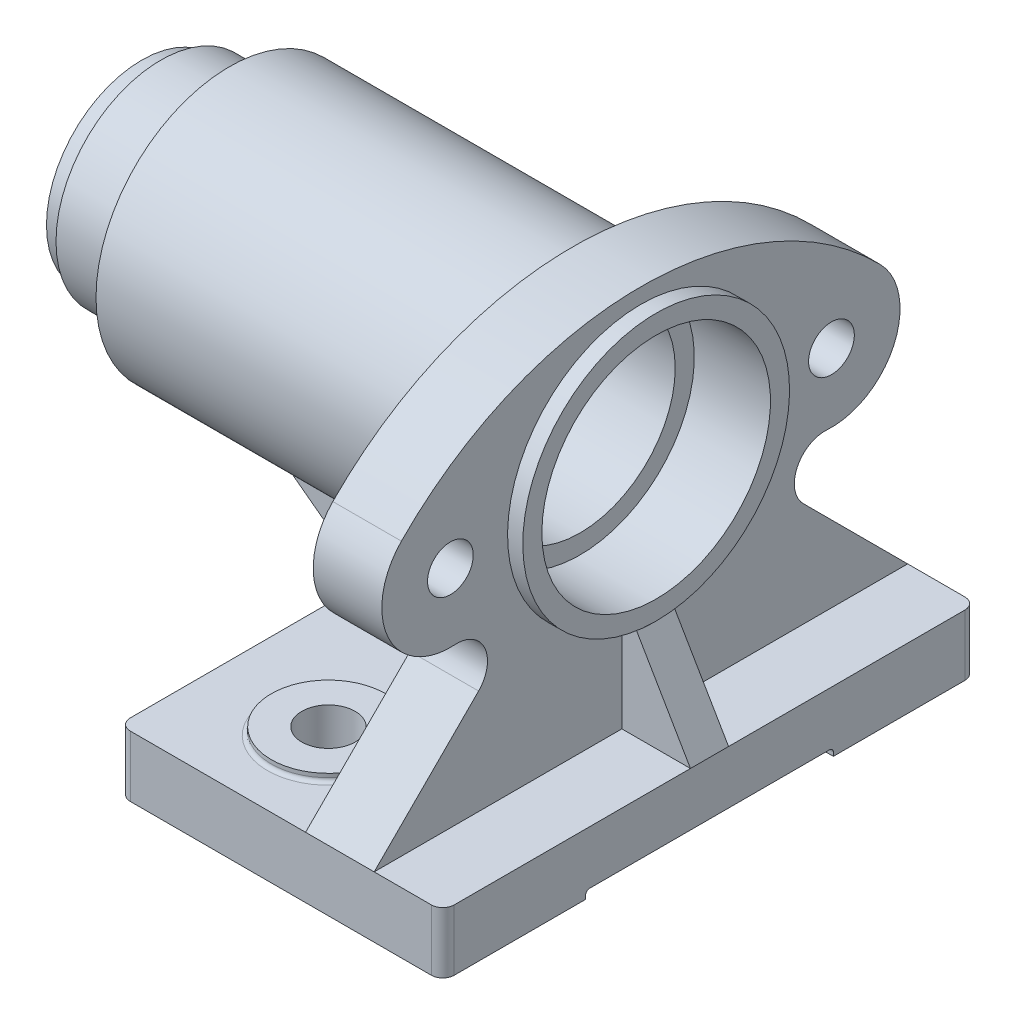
ISO-10303-21;
HEADER;
FILE_DESCRIPTION(('STEP AP214'),'2;1');
FILE_NAME('part.step','',(''),(''),'','','');
FILE_SCHEMA(('AUTOMOTIVE_DESIGN { 1 0 10303 214 1 1 1 1 }'));
ENDSEC;
DATA;
#1=APPLICATION_CONTEXT('core data for automotive mechanical design processes');
#2=APPLICATION_PROTOCOL_DEFINITION('international standard','automotive_design',2000,#1);
#3=PRODUCT_CONTEXT('',#1,'mechanical');
#4=PRODUCT('Part','Part','',(#3));
#5=PRODUCT_RELATED_PRODUCT_CATEGORY('part','',(#4));
#6=PRODUCT_DEFINITION_FORMATION('','',#4);
#7=PRODUCT_DEFINITION_CONTEXT('part definition',#1,'design');
#8=PRODUCT_DEFINITION('design','',#6,#7);
#9=PRODUCT_DEFINITION_SHAPE('','',#8);
#10=(LENGTH_UNIT() NAMED_UNIT(*) SI_UNIT(.MILLI.,.METRE.));
#11=(NAMED_UNIT(*) PLANE_ANGLE_UNIT() SI_UNIT($,.RADIAN.));
#12=(NAMED_UNIT(*) SI_UNIT($,.STERADIAN.) SOLID_ANGLE_UNIT());
#13=UNCERTAINTY_MEASURE_WITH_UNIT(LENGTH_MEASURE(1.E-05),#10,'distance_accuracy_value','');
#14=(GEOMETRIC_REPRESENTATION_CONTEXT(3) GLOBAL_UNCERTAINTY_ASSIGNED_CONTEXT((#13)) GLOBAL_UNIT_ASSIGNED_CONTEXT((#10,
#11,#12)) REPRESENTATION_CONTEXT('',''));
#15=CARTESIAN_POINT('',(0.,0.,0.));
#16=DIRECTION('',(0.,0.,1.));
#17=DIRECTION('',(1.,0.,0.));
#18=AXIS2_PLACEMENT_3D('',#15,#16,#17);
#19=CARTESIAN_POINT('',(-85.,0.,70.));
#20=DIRECTION('',(0.,1.,0.));
#21=DIRECTION('',(-1.,0.,0.));
#22=AXIS2_PLACEMENT_3D('',#19,#20,#21);
#23=PLANE('',#22);
#24=CARTESIAN_POINT('',(-55.,0.,45.));
#25=DIRECTION('',(0.,1.,0.));
#26=DIRECTION('',(-1.,0.,0.));
#27=AXIS2_PLACEMENT_3D('',#24,#25,#26);
#28=CIRCLE('',#27,7.);
#29=CARTESIAN_POINT('',(-62.,0.,45.));
#30=VERTEX_POINT('',#29);
#31=EDGE_CURVE('E662',#30,#30,#28,.T.);
#32=ORIENTED_EDGE('',*,*,#31,.T.);
#33=EDGE_LOOP('',(#32));
#34=FACE_BOUND('',#33,.T.);
#35=DIRECTION('',(1.,0.,0.));
#36=VECTOR('',#35,1.);
#37=CARTESIAN_POINT('',(-85.,0.,70.));
#38=LINE('',#37,#36);
#39=CARTESIAN_POINT('',(-82.,0.,70.));
#40=VERTEX_POINT('',#39);
#41=CARTESIAN_POINT('',(-3.,0.,70.));
#42=VERTEX_POINT('',#41);
#43=EDGE_CURVE('E286',#40,#42,#38,.T.);
#44=ORIENTED_EDGE('',*,*,#43,.F.);
#45=CARTESIAN_POINT('',(-82.,0.,67.));
#46=DIRECTION('',(0.,1.,0.));
#47=DIRECTION('',(-1.,0.,0.));
#48=AXIS2_PLACEMENT_3D('',#45,#46,#47);
#49=CIRCLE('',#48,3.);
#50=CARTESIAN_POINT('',(-85.,0.,67.));
#51=VERTEX_POINT('',#50);
#52=EDGE_CURVE('E485',#40,#51,#49,.F.);
#53=ORIENTED_EDGE('',*,*,#52,.T.);
#54=DIRECTION('',(0.,0.,-1.));
#55=VECTOR('',#54,1.);
#56=CARTESIAN_POINT('',(-85.,0.,70.));
#57=LINE('',#56,#55);
#58=CARTESIAN_POINT('',(-85.,0.,32.5));
#59=VERTEX_POINT('',#58);
#60=EDGE_CURVE('E281',#51,#59,#57,.T.);
#61=ORIENTED_EDGE('',*,*,#60,.T.);
#62=DIRECTION('',(1.,0.,0.));
#63=VECTOR('',#62,1.);
#64=CARTESIAN_POINT('',(-92.,0.,32.5));
#65=LINE('',#64,#63);
#66=CARTESIAN_POINT('',(0.,0.,32.5));
#67=VERTEX_POINT('',#66);
#68=EDGE_CURVE('E243',#59,#67,#65,.T.);
#69=ORIENTED_EDGE('',*,*,#68,.T.);
#70=DIRECTION('',(0.,0.,-1.));
#71=VECTOR('',#70,1.);
#72=CARTESIAN_POINT('',(0.,0.,70.));
#73=LINE('',#72,#71);
#74=CARTESIAN_POINT('',(0.,0.,67.));
#75=VERTEX_POINT('',#74);
#76=EDGE_CURVE('E260',#75,#67,#73,.T.);
#77=ORIENTED_EDGE('',*,*,#76,.F.);
#78=CARTESIAN_POINT('',(-3.,0.,67.));
#79=DIRECTION('',(0.,1.,0.));
#80=DIRECTION('',(-1.,0.,0.));
#81=AXIS2_PLACEMENT_3D('',#78,#79,#80);
#82=CIRCLE('',#81,3.);
#83=EDGE_CURVE('E489',#75,#42,#82,.F.);
#84=ORIENTED_EDGE('',*,*,#83,.T.);
#85=EDGE_LOOP('',(#44,#53,#61,#69,#77,#84));
#86=FACE_BOUND('',#85,.T.);
#87=ADVANCED_FACE('F33',(#34,#86),#23,.F.);
#88=CARTESIAN_POINT('',(0.,16.,70.));
#89=DIRECTION('',(0.,-1.,0.));
#90=DIRECTION('',(1.,0.,0.));
#91=AXIS2_PLACEMENT_3D('',#88,#89,#90);
#92=PLANE('',#91);
#93=CARTESIAN_POINT('',(-55.,16.,45.));
#94=DIRECTION('',(0.,-1.,0.));
#95=DIRECTION('',(1.,0.,0.));
#96=AXIS2_PLACEMENT_3D('',#93,#94,#95);
#97=CIRCLE('',#96,16.);
#98=CARTESIAN_POINT('',(-39.,16.,45.));
#99=VERTEX_POINT('',#98);
#100=EDGE_CURVE('E306',#99,#99,#97,.T.);
#101=ORIENTED_EDGE('',*,*,#100,.T.);
#102=EDGE_LOOP('',(#101));
#103=FACE_BOUND('',#102,.T.);
#104=DIRECTION('',(0.,0.,-1.));
#105=VECTOR('',#104,1.);
#106=CARTESIAN_POINT('',(-85.,16.,70.));
#107=LINE('',#106,#105);
#108=CARTESIAN_POINT('',(-85.,16.,67.));
#109=VERTEX_POINT('',#108);
#110=CARTESIAN_POINT('',(-85.,16.,5.));
#111=VERTEX_POINT('',#110);
#112=EDGE_CURVE('E505',#109,#111,#107,.T.);
#113=ORIENTED_EDGE('',*,*,#112,.F.);
#114=CARTESIAN_POINT('',(-82.,16.,67.));
#115=DIRECTION('',(0.,-1.,0.));
#116=DIRECTION('',(1.,0.,0.));
#117=AXIS2_PLACEMENT_3D('',#114,#115,#116);
#118=CIRCLE('',#117,3.);
#119=CARTESIAN_POINT('',(-82.,16.,70.));
#120=VERTEX_POINT('',#119);
#121=EDGE_CURVE('E487',#109,#120,#118,.F.);
#122=ORIENTED_EDGE('',*,*,#121,.T.);
#123=DIRECTION('',(-1.,0.,0.));
#124=VECTOR('',#123,1.);
#125=CARTESIAN_POINT('',(0.,16.,70.));
#126=LINE('',#125,#124);
#127=CARTESIAN_POINT('',(-36.,16.,70.));
#128=VERTEX_POINT('',#127);
#129=EDGE_CURVE('E275',#128,#120,#126,.T.);
#130=ORIENTED_EDGE('',*,*,#129,.F.);
#131=DIRECTION('',(0.,0.,-1.));
#132=VECTOR('',#131,1.);
#133=CARTESIAN_POINT('',(-36.,16.,70.));
#134=LINE('',#133,#132);
#135=CARTESIAN_POINT('',(-36.,16.,5.));
#136=VERTEX_POINT('',#135);
#137=EDGE_CURVE('E408',#128,#136,#134,.T.);
#138=ORIENTED_EDGE('',*,*,#137,.T.);
#139=DIRECTION('',(-1.,0.,0.));
#140=VECTOR('',#139,1.);
#141=CARTESIAN_POINT('',(0.,16.,5.));
#142=LINE('',#141,#140);
#143=EDGE_CURVE('E687',#136,#111,#142,.T.);
#144=ORIENTED_EDGE('',*,*,#143,.T.);
#145=EDGE_LOOP('',(#113,#122,#130,#138,#144));
#146=FACE_BOUND('',#145,.T.);
#147=ADVANCED_FACE('F522',(#103,#146),#92,.F.);
#148=CARTESIAN_POINT('',(-55.,16.,-45.));
#149=DIRECTION('',(0.,-1.,0.));
#150=DIRECTION('',(1.,0.,0.));
#151=AXIS2_PLACEMENT_3D('',#148,#149,#150);
#152=CIRCLE('',#151,16.);
#153=CARTESIAN_POINT('',(-39.,16.,-45.));
#154=VERTEX_POINT('',#153);
#155=EDGE_CURVE('E312',#154,#154,#152,.T.);
#156=ORIENTED_EDGE('',*,*,#155,.T.);
#157=EDGE_LOOP('',(#156));
#158=FACE_BOUND('',#157,.T.);
#159=DIRECTION('',(-1.,0.,0.));
#160=VECTOR('',#159,1.);
#161=CARTESIAN_POINT('',(0.,16.,-70.));
#162=LINE('',#161,#160);
#163=CARTESIAN_POINT('',(-36.,16.,-70.));
#164=VERTEX_POINT('',#163);
#165=CARTESIAN_POINT('',(-82.,16.,-70.));
#166=VERTEX_POINT('',#165);
#167=EDGE_CURVE('E269',#164,#166,#162,.T.);
#168=ORIENTED_EDGE('',*,*,#167,.T.);
#169=CARTESIAN_POINT('',(-82.,16.,-67.));
#170=DIRECTION('',(0.,-1.,0.));
#171=DIRECTION('',(1.,0.,0.));
#172=AXIS2_PLACEMENT_3D('',#169,#170,#171);
#173=CIRCLE('',#172,3.);
#174=CARTESIAN_POINT('',(-85.,16.,-67.));
#175=VERTEX_POINT('',#174);
#176=EDGE_CURVE('E293',#166,#175,#173,.F.);
#177=ORIENTED_EDGE('',*,*,#176,.T.);
#178=CARTESIAN_POINT('',(-85.,16.,-5.));
#179=VERTEX_POINT('',#178);
#180=EDGE_CURVE('E506',#179,#175,#107,.T.);
#181=ORIENTED_EDGE('',*,*,#180,.F.);
#182=DIRECTION('',(-1.,0.,0.));
#183=VECTOR('',#182,1.);
#184=CARTESIAN_POINT('',(0.,16.,-5.));
#185=LINE('',#184,#183);
#186=CARTESIAN_POINT('',(-36.,16.,-5.));
#187=VERTEX_POINT('',#186);
#188=EDGE_CURVE('E678',#187,#179,#185,.T.);
#189=ORIENTED_EDGE('',*,*,#188,.F.);
#190=EDGE_CURVE('E406',#187,#164,#134,.T.);
#191=ORIENTED_EDGE('',*,*,#190,.T.);
#192=EDGE_LOOP('',(#168,#177,#181,#189,#191));
#193=FACE_BOUND('',#192,.T.);
#194=ADVANCED_FACE('F477',(#158,#193),#92,.F.);
#195=DIRECTION('',(0.,0.,-1.));
#196=VECTOR('',#195,1.);
#197=CARTESIAN_POINT('',(0.,16.,70.));
#198=LINE('',#197,#196);
#199=CARTESIAN_POINT('',(0.,16.,-5.));
#200=VERTEX_POINT('',#199);
#201=CARTESIAN_POINT('',(0.,16.,-67.));
#202=VERTEX_POINT('',#201);
#203=EDGE_CURVE('E265',#200,#202,#198,.T.);
#204=ORIENTED_EDGE('',*,*,#203,.T.);
#205=CARTESIAN_POINT('',(-3.,16.,-67.));
#206=DIRECTION('',(0.,-1.,0.));
#207=DIRECTION('',(1.,0.,0.));
#208=AXIS2_PLACEMENT_3D('',#205,#206,#207);
#209=CIRCLE('',#208,3.);
#210=CARTESIAN_POINT('',(-3.,16.,-70.));
#211=VERTEX_POINT('',#210);
#212=EDGE_CURVE('E299',#202,#211,#209,.F.);
#213=ORIENTED_EDGE('',*,*,#212,.T.);
#214=CARTESIAN_POINT('',(-18.,16.,-70.));
#215=VERTEX_POINT('',#214);
#216=EDGE_CURVE('E273',#211,#215,#162,.T.);
#217=ORIENTED_EDGE('',*,*,#216,.T.);
#218=DIRECTION('',(0.,0.,-1.));
#219=VECTOR('',#218,1.);
#220=CARTESIAN_POINT('',(-18.,16.,70.));
#221=LINE('',#220,#219);
#222=CARTESIAN_POINT('',(-18.,16.,-5.));
#223=VERTEX_POINT('',#222);
#224=EDGE_CURVE('E398',#223,#215,#221,.T.);
#225=ORIENTED_EDGE('',*,*,#224,.F.);
#226=DIRECTION('',(-1.,0.,0.));
#227=VECTOR('',#226,1.);
#228=CARTESIAN_POINT('',(0.,16.,-5.));
#229=LINE('',#228,#227);
#230=EDGE_CURVE('E504',#200,#223,#229,.T.);
#231=ORIENTED_EDGE('',*,*,#230,.F.);
#232=EDGE_LOOP('',(#204,#213,#217,#225,#231));
#233=FACE_BOUND('',#232,.T.);
#234=ADVANCED_FACE('F501',(#233),#92,.F.);
#235=CARTESIAN_POINT('',(-3.,16.,70.));
#236=VERTEX_POINT('',#235);
#237=CARTESIAN_POINT('',(-18.,16.,70.));
#238=VERTEX_POINT('',#237);
#239=EDGE_CURVE('E349',#236,#238,#126,.T.);
#240=ORIENTED_EDGE('',*,*,#239,.F.);
#241=CARTESIAN_POINT('',(-3.,16.,67.));
#242=DIRECTION('',(0.,-1.,0.));
#243=DIRECTION('',(1.,0.,0.));
#244=AXIS2_PLACEMENT_3D('',#241,#242,#243);
#245=CIRCLE('',#244,3.);
#246=CARTESIAN_POINT('',(0.,16.,67.));
#247=VERTEX_POINT('',#246);
#248=EDGE_CURVE('E301',#236,#247,#245,.F.);
#249=ORIENTED_EDGE('',*,*,#248,.T.);
#250=CARTESIAN_POINT('',(0.,16.,5.));
#251=VERTEX_POINT('',#250);
#252=EDGE_CURVE('E261',#247,#251,#198,.T.);
#253=ORIENTED_EDGE('',*,*,#252,.T.);
#254=DIRECTION('',(-1.,0.,0.));
#255=VECTOR('',#254,1.);
#256=CARTESIAN_POINT('',(0.,16.,5.));
#257=LINE('',#256,#255);
#258=CARTESIAN_POINT('',(-18.,16.,5.));
#259=VERTEX_POINT('',#258);
#260=EDGE_CURVE('E541',#251,#259,#257,.T.);
#261=ORIENTED_EDGE('',*,*,#260,.T.);
#262=EDGE_CURVE('E394',#238,#259,#221,.T.);
#263=ORIENTED_EDGE('',*,*,#262,.F.);
#264=EDGE_LOOP('',(#240,#249,#253,#261,#263));
#265=FACE_BOUND('',#264,.T.);
#266=ADVANCED_FACE('F539',(#265),#92,.F.);
#267=CARTESIAN_POINT('',(-55.,0.,-45.));
#268=DIRECTION('',(0.,1.,0.));
#269=DIRECTION('',(-1.,0.,0.));
#270=AXIS2_PLACEMENT_3D('',#267,#268,#269);
#271=CIRCLE('',#270,7.);
#272=CARTESIAN_POINT('',(-62.,0.,-45.));
#273=VERTEX_POINT('',#272);
#274=EDGE_CURVE('E653',#273,#273,#271,.T.);
#275=ORIENTED_EDGE('',*,*,#274,.T.);
#276=EDGE_LOOP('',(#275));
#277=FACE_BOUND('',#276,.T.);
#278=CARTESIAN_POINT('',(-85.,0.,-32.5));
#279=VERTEX_POINT('',#278);
#280=CARTESIAN_POINT('',(-85.,0.,-67.));
#281=VERTEX_POINT('',#280);
#282=EDGE_CURVE('E350',#279,#281,#57,.T.);
#283=ORIENTED_EDGE('',*,*,#282,.T.);
#284=CARTESIAN_POINT('',(-82.,0.,-67.));
#285=DIRECTION('',(0.,1.,0.));
#286=DIRECTION('',(-1.,0.,0.));
#287=AXIS2_PLACEMENT_3D('',#284,#285,#286);
#288=CIRCLE('',#287,3.);
#289=CARTESIAN_POINT('',(-82.,0.,-70.));
#290=VERTEX_POINT('',#289);
#291=EDGE_CURVE('E287',#281,#290,#288,.F.);
#292=ORIENTED_EDGE('',*,*,#291,.T.);
#293=DIRECTION('',(1.,0.,0.));
#294=VECTOR('',#293,1.);
#295=CARTESIAN_POINT('',(-85.,0.,-70.));
#296=LINE('',#295,#294);
#297=CARTESIAN_POINT('',(-3.,0.,-70.));
#298=VERTEX_POINT('',#297);
#299=EDGE_CURVE('E274',#290,#298,#296,.T.);
#300=ORIENTED_EDGE('',*,*,#299,.T.);
#301=CARTESIAN_POINT('',(-3.,0.,-67.));
#302=DIRECTION('',(0.,1.,0.));
#303=DIRECTION('',(-1.,0.,0.));
#304=AXIS2_PLACEMENT_3D('',#301,#302,#303);
#305=CIRCLE('',#304,3.);
#306=CARTESIAN_POINT('',(0.,0.,-67.));
#307=VERTEX_POINT('',#306);
#308=EDGE_CURVE('E259',#298,#307,#305,.F.);
#309=ORIENTED_EDGE('',*,*,#308,.T.);
#310=CARTESIAN_POINT('',(0.,0.,-32.5));
#311=VERTEX_POINT('',#310);
#312=EDGE_CURVE('E250',#311,#307,#73,.T.);
#313=ORIENTED_EDGE('',*,*,#312,.F.);
#314=DIRECTION('',(1.,0.,0.));
#315=VECTOR('',#314,1.);
#316=CARTESIAN_POINT('',(-92.,0.,-32.5));
#317=LINE('',#316,#315);
#318=EDGE_CURVE('E232',#279,#311,#317,.T.);
#319=ORIENTED_EDGE('',*,*,#318,.F.);
#320=EDGE_LOOP('',(#283,#292,#300,#309,#313,#319));
#321=FACE_BOUND('',#320,.T.);
#322=ADVANCED_FACE('F256',(#277,#321),#23,.F.);
#323=CARTESIAN_POINT('',(0.,0.,70.));
#324=DIRECTION('',(-1.,0.,0.));
#325=DIRECTION('',(0.,-1.,0.));
#326=AXIS2_PLACEMENT_3D('',#323,#324,#325);
#327=PLANE('',#326);
#328=ORIENTED_EDGE('',*,*,#312,.T.);
#329=DIRECTION('',(0.,1.,0.));
#330=VECTOR('',#329,1.);
#331=CARTESIAN_POINT('',(0.,0.,-67.));
#332=LINE('',#331,#330);
#333=EDGE_CURVE('E297',#307,#202,#332,.T.);
#334=ORIENTED_EDGE('',*,*,#333,.T.);
#335=ORIENTED_EDGE('',*,*,#203,.F.);
#336=DIRECTION('',(0.,0.,-1.));
#337=VECTOR('',#336,1.);
#338=CARTESIAN_POINT('',(0.,16.,70.));
#339=LINE('',#338,#337);
#340=EDGE_CURVE('E570',#251,#200,#339,.T.);
#341=ORIENTED_EDGE('',*,*,#340,.F.);
#342=ORIENTED_EDGE('',*,*,#252,.F.);
#343=DIRECTION('',(0.,1.,0.));
#344=VECTOR('',#343,1.);
#345=CARTESIAN_POINT('',(0.,0.,67.));
#346=LINE('',#345,#344);
#347=EDGE_CURVE('E295',#247,#75,#346,.F.);
#348=ORIENTED_EDGE('',*,*,#347,.T.);
#349=ORIENTED_EDGE('',*,*,#76,.T.);
#350=DIRECTION('',(0.,-1.,0.));
#351=VECTOR('',#350,1.);
#352=CARTESIAN_POINT('',(0.,0.,32.5));
#353=LINE('',#352,#351);
#354=CARTESIAN_POINT('',(0.,1.,32.5));
#355=VERTEX_POINT('',#354);
#356=EDGE_CURVE('E244',#355,#67,#353,.T.);
#357=ORIENTED_EDGE('',*,*,#356,.F.);
#358=CARTESIAN_POINT('',(0.,1.,31.5));
#359=DIRECTION('',(-1.,0.,0.));
#360=DIRECTION('',(0.,-1.,0.));
#361=AXIS2_PLACEMENT_3D('',#358,#359,#360);
#362=CIRCLE('',#361,1.);
#363=CARTESIAN_POINT('',(0.,2.,31.5));
#364=VERTEX_POINT('',#363);
#365=EDGE_CURVE('E41',#355,#364,#362,.T.);
#366=ORIENTED_EDGE('',*,*,#365,.T.);
#367=DIRECTION('',(0.,0.,1.));
#368=VECTOR('',#367,1.);
#369=CARTESIAN_POINT('',(0.,2.,32.5));
#370=LINE('',#369,#368);
#371=CARTESIAN_POINT('',(0.,2.,-31.5));
#372=VERTEX_POINT('',#371);
#373=EDGE_CURVE('E254',#372,#364,#370,.T.);
#374=ORIENTED_EDGE('',*,*,#373,.F.);
#375=CARTESIAN_POINT('',(0.,1.,-31.5));
#376=DIRECTION('',(-1.,0.,0.));
#377=DIRECTION('',(0.,-1.,0.));
#378=AXIS2_PLACEMENT_3D('',#375,#376,#377);
#379=CIRCLE('',#378,1.);
#380=CARTESIAN_POINT('',(0.,1.,-32.5));
#381=VERTEX_POINT('',#380);
#382=EDGE_CURVE('E253',#372,#381,#379,.T.);
#383=ORIENTED_EDGE('',*,*,#382,.T.);
#384=DIRECTION('',(0.,1.,0.));
#385=VECTOR('',#384,1.);
#386=CARTESIAN_POINT('',(0.,2.,-32.5));
#387=LINE('',#386,#385);
#388=EDGE_CURVE('E235',#311,#381,#387,.T.);
#389=ORIENTED_EDGE('',*,*,#388,.F.);
#390=EDGE_LOOP('',(#328,#334,#335,#341,#342,#348,#349,#357,#366,#374,#383,#389));
#391=FACE_BOUND('',#390,.T.);
#392=ADVANCED_FACE('F248',(#391),#327,.F.);
#393=CARTESIAN_POINT('',(-85.,16.,70.));
#394=DIRECTION('',(1.,0.,0.));
#395=DIRECTION('',(0.,0.,-1.));
#396=AXIS2_PLACEMENT_3D('',#393,#394,#395);
#397=PLANE('',#396);
#398=ORIENTED_EDGE('',*,*,#60,.F.);
#399=DIRECTION('',(0.,-1.,0.));
#400=VECTOR('',#399,1.);
#401=CARTESIAN_POINT('',(-85.,16.,67.));
#402=LINE('',#401,#400);
#403=EDGE_CURVE('E484',#51,#109,#402,.F.);
#404=ORIENTED_EDGE('',*,*,#403,.T.);
#405=ORIENTED_EDGE('',*,*,#112,.T.);
#406=DIRECTION('',(0.,0.,1.));
#407=VECTOR('',#406,1.);
#408=CARTESIAN_POINT('',(-85.,16.,70.));
#409=LINE('',#408,#407);
#410=EDGE_CURVE('E691',#111,#179,#409,.F.);
#411=ORIENTED_EDGE('',*,*,#410,.T.);
#412=ORIENTED_EDGE('',*,*,#180,.T.);
#413=DIRECTION('',(0.,-1.,0.));
#414=VECTOR('',#413,1.);
#415=CARTESIAN_POINT('',(-85.,16.,-67.));
#416=LINE('',#415,#414);
#417=EDGE_CURVE('E483',#175,#281,#416,.T.);
#418=ORIENTED_EDGE('',*,*,#417,.T.);
#419=ORIENTED_EDGE('',*,*,#282,.F.);
#420=DIRECTION('',(0.,1.,0.));
#421=VECTOR('',#420,1.);
#422=CARTESIAN_POINT('',(-85.,16.,-32.5));
#423=LINE('',#422,#421);
#424=CARTESIAN_POINT('',(-85.,1.,-32.5));
#425=VERTEX_POINT('',#424);
#426=EDGE_CURVE('E238',#279,#425,#423,.T.);
#427=ORIENTED_EDGE('',*,*,#426,.T.);
#428=CARTESIAN_POINT('',(-85.,1.,-31.5));
#429=DIRECTION('',(1.,0.,0.));
#430=DIRECTION('',(0.,0.,-1.));
#431=AXIS2_PLACEMENT_3D('',#428,#429,#430);
#432=CIRCLE('',#431,1.);
#433=CARTESIAN_POINT('',(-85.,2.,-31.5));
#434=VERTEX_POINT('',#433);
#435=EDGE_CURVE('E325',#425,#434,#432,.T.);
#436=ORIENTED_EDGE('',*,*,#435,.T.);
#437=DIRECTION('',(0.,0.,1.));
#438=VECTOR('',#437,1.);
#439=CARTESIAN_POINT('',(-85.,2.,70.));
#440=LINE('',#439,#438);
#441=CARTESIAN_POINT('',(-85.,2.,31.5));
#442=VERTEX_POINT('',#441);
#443=EDGE_CURVE('E341',#434,#442,#440,.T.);
#444=ORIENTED_EDGE('',*,*,#443,.T.);
#445=CARTESIAN_POINT('',(-85.,1.,31.5));
#446=DIRECTION('',(1.,0.,0.));
#447=DIRECTION('',(0.,0.,-1.));
#448=AXIS2_PLACEMENT_3D('',#445,#446,#447);
#449=CIRCLE('',#448,1.);
#450=CARTESIAN_POINT('',(-85.,1.,32.5));
#451=VERTEX_POINT('',#450);
#452=EDGE_CURVE('E11',#442,#451,#449,.T.);
#453=ORIENTED_EDGE('',*,*,#452,.T.);
#454=DIRECTION('',(0.,-1.,0.));
#455=VECTOR('',#454,1.);
#456=CARTESIAN_POINT('',(-85.,16.,32.5));
#457=LINE('',#456,#455);
#458=EDGE_CURVE('E336',#451,#59,#457,.T.);
#459=ORIENTED_EDGE('',*,*,#458,.T.);
#460=EDGE_LOOP('',(#398,#404,#405,#411,#412,#418,#419,#427,#436,#444,#453,#459));
#461=FACE_BOUND('',#460,.T.);
#462=ADVANCED_FACE('F514',(#461),#397,.F.);
#463=CARTESIAN_POINT('',(0.,0.,70.));
#464=DIRECTION('',(0.,0.,1.));
#465=DIRECTION('',(1.,0.,0.));
#466=AXIS2_PLACEMENT_3D('',#463,#464,#465);
#467=PLANE('',#466);
#468=ORIENTED_EDGE('',*,*,#129,.T.);
#469=DIRECTION('',(0.,-1.,0.));
#470=VECTOR('',#469,1.);
#471=CARTESIAN_POINT('',(-82.,0.,70.));
#472=LINE('',#471,#470);
#473=EDGE_CURVE('E344',#120,#40,#472,.T.);
#474=ORIENTED_EDGE('',*,*,#473,.T.);
#475=ORIENTED_EDGE('',*,*,#43,.T.);
#476=DIRECTION('',(0.,1.,0.));
#477=VECTOR('',#476,1.);
#478=CARTESIAN_POINT('',(-3.,16.,70.));
#479=LINE('',#478,#477);
#480=EDGE_CURVE('E340',#42,#236,#479,.T.);
#481=ORIENTED_EDGE('',*,*,#480,.T.);
#482=ORIENTED_EDGE('',*,*,#239,.T.);
#483=DIRECTION('',(1.,0.,0.));
#484=VECTOR('',#483,1.);
#485=CARTESIAN_POINT('',(-36.,16.,70.));
#486=LINE('',#485,#484);
#487=EDGE_CURVE('E371',#128,#238,#486,.T.);
#488=ORIENTED_EDGE('',*,*,#487,.F.);
#489=EDGE_LOOP('',(#468,#474,#475,#481,#482,#488));
#490=FACE_BOUND('',#489,.T.);
#491=ADVANCED_FACE('F525',(#490),#467,.T.);
#492=CARTESIAN_POINT('',(0.,0.,-70.));
#493=DIRECTION('',(0.,0.,1.));
#494=DIRECTION('',(1.,0.,0.));
#495=AXIS2_PLACEMENT_3D('',#492,#493,#494);
#496=PLANE('',#495);
#497=ORIENTED_EDGE('',*,*,#299,.F.);
#498=DIRECTION('',(0.,-1.,0.));
#499=VECTOR('',#498,1.);
#500=CARTESIAN_POINT('',(-82.,0.,-70.));
#501=LINE('',#500,#499);
#502=EDGE_CURVE('E291',#290,#166,#501,.F.);
#503=ORIENTED_EDGE('',*,*,#502,.T.);
#504=ORIENTED_EDGE('',*,*,#167,.F.);
#505=DIRECTION('',(1.,0.,0.));
#506=VECTOR('',#505,1.);
#507=CARTESIAN_POINT('',(-36.,16.,-70.));
#508=LINE('',#507,#506);
#509=EDGE_CURVE('E360',#164,#215,#508,.T.);
#510=ORIENTED_EDGE('',*,*,#509,.T.);
#511=ORIENTED_EDGE('',*,*,#216,.F.);
#512=DIRECTION('',(0.,1.,0.));
#513=VECTOR('',#512,1.);
#514=CARTESIAN_POINT('',(-3.,0.,-70.));
#515=LINE('',#514,#513);
#516=EDGE_CURVE('E289',#211,#298,#515,.F.);
#517=ORIENTED_EDGE('',*,*,#516,.T.);
#518=EDGE_LOOP('',(#497,#503,#504,#510,#511,#517));
#519=FACE_BOUND('',#518,.T.);
#520=ADVANCED_FACE('F473',(#519),#496,.F.);
#521=CARTESIAN_POINT('',(-36.,16.,70.));
#522=DIRECTION('',(0.,0.707106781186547,0.707106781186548));
#523=DIRECTION('',(0.,-0.707106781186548,0.707106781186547));
#524=AXIS2_PLACEMENT_3D('',#521,#522,#523);
#525=PLANE('',#524);
#526=DIRECTION('',(0.,-0.707106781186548,0.707106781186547));
#527=VECTOR('',#526,1.);
#528=CARTESIAN_POINT('',(-18.,16.,70.));
#529=LINE('',#528,#527);
#530=CARTESIAN_POINT('',(-18.,43.4017639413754,42.5982360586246));
#531=VERTEX_POINT('',#530);
#532=EDGE_CURVE('E375',#531,#238,#529,.T.);
#533=ORIENTED_EDGE('',*,*,#532,.F.);
#534=DIRECTION('',(1.,0.,0.));
#535=VECTOR('',#534,1.);
#536=CARTESIAN_POINT('',(-36.,43.4017639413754,42.5982360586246));
#537=LINE('',#536,#535);
#538=CARTESIAN_POINT('',(-36.,43.4017639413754,42.5982360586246));
#539=VERTEX_POINT('',#538);
#540=EDGE_CURVE('E369',#539,#531,#537,.T.);
#541=ORIENTED_EDGE('',*,*,#540,.F.);
#542=DIRECTION('',(0.,-0.707106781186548,0.707106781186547));
#543=VECTOR('',#542,1.);
#544=CARTESIAN_POINT('',(-36.,16.,70.));
#545=LINE('',#544,#543);
#546=EDGE_CURVE('E426',#539,#128,#545,.T.);
#547=ORIENTED_EDGE('',*,*,#546,.T.);
#548=ORIENTED_EDGE('',*,*,#487,.T.);
#549=EDGE_LOOP('',(#533,#541,#547,#548));
#550=FACE_BOUND('',#549,.T.);
#551=ADVANCED_FACE('F529',(#550),#525,.T.);
#552=CARTESIAN_POINT('',(-36.,49.0586181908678,48.255090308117));
#553=DIRECTION('',(1.,0.,0.));
#554=DIRECTION('',(0.,0.,-1.));
#555=AXIS2_PLACEMENT_3D('',#552,#553,#554);
#556=CYLINDRICAL_SURFACE('',#555,8.);
#557=CARTESIAN_POINT('',(-18.,49.0586181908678,48.255090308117));
#558=DIRECTION('',(-1.,0.,0.));
#559=DIRECTION('',(0.,0.,-1.));
#560=AXIS2_PLACEMENT_3D('',#557,#558,#559);
#561=CIRCLE('',#560,8.);
#562=CARTESIAN_POINT('',(-18.,57.0405818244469,48.7919855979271));
#563=VERTEX_POINT('',#562);
#564=EDGE_CURVE('E372',#563,#531,#561,.T.);
#565=ORIENTED_EDGE('',*,*,#564,.F.);
#566=DIRECTION('',(1.,0.,0.));
#567=VECTOR('',#566,1.);
#568=CARTESIAN_POINT('',(-36.,57.0405818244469,48.7919855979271));
#569=LINE('',#568,#567);
#570=CARTESIAN_POINT('',(-36.,57.0405818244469,48.7919855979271));
#571=VERTEX_POINT('',#570);
#572=EDGE_CURVE('E367',#571,#563,#569,.T.);
#573=ORIENTED_EDGE('',*,*,#572,.F.);
#574=CARTESIAN_POINT('',(-36.,49.0586181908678,48.255090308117));
#575=DIRECTION('',(-1.,0.,0.));
#576=DIRECTION('',(0.,0.,-1.));
#577=AXIS2_PLACEMENT_3D('',#574,#575,#576);
#578=CIRCLE('',#577,8.);
#579=EDGE_CURVE('E390',#571,#539,#578,.T.);
#580=ORIENTED_EDGE('',*,*,#579,.T.);
#581=ORIENTED_EDGE('',*,*,#540,.T.);
#582=EDGE_LOOP('',(#565,#573,#580,#581));
#583=FACE_BOUND('',#582,.T.);
#584=ADVANCED_FACE('F1168',(#583),#556,.F.);
#585=CARTESIAN_POINT('',(-36.,75.,50.));
#586=DIRECTION('',(1.,0.,0.));
#587=DIRECTION('',(0.,0.,-1.));
#588=AXIS2_PLACEMENT_3D('',#585,#586,#587);
#589=CYLINDRICAL_SURFACE('',#588,18.);
#590=CARTESIAN_POINT('',(-18.,75.,50.));
#591=DIRECTION('',(1.,0.,0.));
#592=DIRECTION('',(0.,0.,1.));
#593=AXIS2_PLACEMENT_3D('',#590,#591,#592);
#594=CIRCLE('',#593,18.);
#595=CARTESIAN_POINT('',(-18.,87.5973758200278,62.8571428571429));
#596=VERTEX_POINT('',#595);
#597=EDGE_CURVE('E376',#596,#563,#594,.T.);
#598=ORIENTED_EDGE('',*,*,#597,.F.);
#599=DIRECTION('',(1.,0.,0.));
#600=VECTOR('',#599,1.);
#601=CARTESIAN_POINT('',(-36.,87.5973758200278,62.8571428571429));
#602=LINE('',#601,#600);
#603=CARTESIAN_POINT('',(-36.,87.5973758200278,62.8571428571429));
#604=VERTEX_POINT('',#603);
#605=EDGE_CURVE('E364',#604,#596,#602,.T.);
#606=ORIENTED_EDGE('',*,*,#605,.F.);
#607=CARTESIAN_POINT('',(-36.,75.,50.));
#608=DIRECTION('',(1.,0.,0.));
#609=DIRECTION('',(0.,0.,1.));
#610=AXIS2_PLACEMENT_3D('',#607,#608,#609);
#611=CIRCLE('',#610,18.);
#612=EDGE_CURVE('E439',#604,#571,#611,.T.);
#613=ORIENTED_EDGE('',*,*,#612,.T.);
#614=ORIENTED_EDGE('',*,*,#572,.T.);
#615=EDGE_LOOP('',(#598,#606,#613,#614));
#616=FACE_BOUND('',#615,.T.);
#617=ADVANCED_FACE('F1115',(#616),#589,.T.);
#618=CARTESIAN_POINT('',(-36.,26.0102051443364,0.));
#619=DIRECTION('',(1.,0.,0.));
#620=DIRECTION('',(0.,0.,-1.));
#621=AXIS2_PLACEMENT_3D('',#618,#619,#620);
#622=CYLINDRICAL_SURFACE('',#621,88.);
#623=ORIENTED_EDGE('',*,*,#605,.T.);
#624=CARTESIAN_POINT('',(-18.,26.0102051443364,0.));
#625=DIRECTION('',(1.,0.,0.));
#626=DIRECTION('',(0.,0.,1.));
#627=AXIS2_PLACEMENT_3D('',#624,#625,#626);
#628=CIRCLE('',#627,88.);
#629=CARTESIAN_POINT('',(-18.,87.5973758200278,-62.8571428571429));
#630=VERTEX_POINT('',#629);
#631=EDGE_CURVE('E379',#630,#596,#628,.T.);
#632=ORIENTED_EDGE('',*,*,#631,.F.);
#633=DIRECTION('',(1.,0.,0.));
#634=VECTOR('',#633,1.);
#635=CARTESIAN_POINT('',(-36.,87.5973758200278,-62.8571428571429));
#636=LINE('',#635,#634);
#637=CARTESIAN_POINT('',(-36.,87.5973758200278,-62.8571428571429));
#638=VERTEX_POINT('',#637);
#639=EDGE_CURVE('E362',#638,#630,#636,.T.);
#640=ORIENTED_EDGE('',*,*,#639,.F.);
#641=CARTESIAN_POINT('',(-36.,26.0102051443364,0.));
#642=DIRECTION('',(1.,0.,0.));
#643=DIRECTION('',(0.,0.,1.));
#644=AXIS2_PLACEMENT_3D('',#641,#642,#643);
#645=CIRCLE('',#644,88.);
#646=EDGE_CURVE('E443',#638,#604,#645,.T.);
#647=ORIENTED_EDGE('',*,*,#646,.T.);
#648=EDGE_LOOP('',(#623,#632,#640,#647));
#649=FACE_BOUND('',#648,.T.);
#650=ADVANCED_FACE('F1109',(#649),#622,.T.);
#651=CARTESIAN_POINT('',(-36.,75.,-50.));
#652=DIRECTION('',(1.,0.,0.));
#653=DIRECTION('',(0.,0.,-1.));
#654=AXIS2_PLACEMENT_3D('',#651,#652,#653);
#655=CYLINDRICAL_SURFACE('',#654,18.);
#656=CARTESIAN_POINT('',(-18.,75.,-50.));
#657=DIRECTION('',(1.,0.,0.));
#658=DIRECTION('',(0.,0.,-1.));
#659=AXIS2_PLACEMENT_3D('',#656,#657,#658);
#660=CIRCLE('',#659,18.);
#661=CARTESIAN_POINT('',(-18.,57.0405818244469,-48.7919855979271));
#662=VERTEX_POINT('',#661);
#663=EDGE_CURVE('E381',#662,#630,#660,.T.);
#664=ORIENTED_EDGE('',*,*,#663,.F.);
#665=DIRECTION('',(1.,0.,0.));
#666=VECTOR('',#665,1.);
#667=CARTESIAN_POINT('',(-36.,57.0405818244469,-48.7919855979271));
#668=LINE('',#667,#666);
#669=CARTESIAN_POINT('',(-36.,57.0405818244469,-48.7919855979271));
#670=VERTEX_POINT('',#669);
#671=EDGE_CURVE('E359',#670,#662,#668,.T.);
#672=ORIENTED_EDGE('',*,*,#671,.F.);
#673=CARTESIAN_POINT('',(-36.,75.,-50.));
#674=DIRECTION('',(1.,0.,0.));
#675=DIRECTION('',(0.,0.,-1.));
#676=AXIS2_PLACEMENT_3D('',#673,#674,#675);
#677=CIRCLE('',#676,18.);
#678=EDGE_CURVE('E447',#670,#638,#677,.T.);
#679=ORIENTED_EDGE('',*,*,#678,.T.);
#680=ORIENTED_EDGE('',*,*,#639,.T.);
#681=EDGE_LOOP('',(#664,#672,#679,#680));
#682=FACE_BOUND('',#681,.T.);
#683=ADVANCED_FACE('F1114',(#682),#655,.T.);
#684=CARTESIAN_POINT('',(-36.,49.0586181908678,-48.255090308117));
#685=DIRECTION('',(1.,0.,0.));
#686=DIRECTION('',(0.,0.,-1.));
#687=AXIS2_PLACEMENT_3D('',#684,#685,#686);
#688=CYLINDRICAL_SURFACE('',#687,8.);
#689=CARTESIAN_POINT('',(-18.,49.0586181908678,-48.255090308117));
#690=DIRECTION('',(-1.,0.,0.));
#691=DIRECTION('',(0.,0.,1.));
#692=AXIS2_PLACEMENT_3D('',#689,#690,#691);
#693=CIRCLE('',#692,8.);
#694=CARTESIAN_POINT('',(-18.,43.4017639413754,-42.5982360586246));
#695=VERTEX_POINT('',#694);
#696=EDGE_CURVE('E384',#695,#662,#693,.T.);
#697=ORIENTED_EDGE('',*,*,#696,.F.);
#698=DIRECTION('',(1.,0.,0.));
#699=VECTOR('',#698,1.);
#700=CARTESIAN_POINT('',(-36.,43.4017639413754,-42.5982360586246));
#701=LINE('',#700,#699);
#702=CARTESIAN_POINT('',(-36.,43.4017639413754,-42.5982360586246));
#703=VERTEX_POINT('',#702);
#704=EDGE_CURVE('E357',#703,#695,#701,.T.);
#705=ORIENTED_EDGE('',*,*,#704,.F.);
#706=CARTESIAN_POINT('',(-36.,49.0586181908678,-48.255090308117));
#707=DIRECTION('',(-1.,0.,0.));
#708=DIRECTION('',(0.,0.,1.));
#709=AXIS2_PLACEMENT_3D('',#706,#707,#708);
#710=CIRCLE('',#709,8.);
#711=EDGE_CURVE('E414',#703,#670,#710,.T.);
#712=ORIENTED_EDGE('',*,*,#711,.T.);
#713=ORIENTED_EDGE('',*,*,#671,.T.);
#714=EDGE_LOOP('',(#697,#705,#712,#713));
#715=FACE_BOUND('',#714,.T.);
#716=ADVANCED_FACE('F456',(#715),#688,.F.);
#717=CARTESIAN_POINT('',(-36.,16.,-70.));
#718=DIRECTION('',(0.,0.707106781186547,-0.707106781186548));
#719=DIRECTION('',(0.,0.707106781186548,0.707106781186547));
#720=AXIS2_PLACEMENT_3D('',#717,#718,#719);
#721=PLANE('',#720);
#722=DIRECTION('',(0.,0.707106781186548,0.707106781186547));
#723=VECTOR('',#722,1.);
#724=CARTESIAN_POINT('',(-18.,16.,-70.));
#725=LINE('',#724,#723);
#726=EDGE_CURVE('E387',#215,#695,#725,.T.);
#727=ORIENTED_EDGE('',*,*,#726,.F.);
#728=ORIENTED_EDGE('',*,*,#509,.F.);
#729=DIRECTION('',(0.,0.707106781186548,0.707106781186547));
#730=VECTOR('',#729,1.);
#731=CARTESIAN_POINT('',(-36.,16.,-70.));
#732=LINE('',#731,#730);
#733=EDGE_CURVE('E419',#164,#703,#732,.T.);
#734=ORIENTED_EDGE('',*,*,#733,.T.);
#735=ORIENTED_EDGE('',*,*,#704,.T.);
#736=EDGE_LOOP('',(#727,#728,#734,#735));
#737=FACE_BOUND('',#736,.T.);
#738=ADVANCED_FACE('F467',(#737),#721,.T.);
#739=CARTESIAN_POINT('',(-36.,49.0586181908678,-48.255090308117));
#740=DIRECTION('',(-1.,0.,0.));
#741=DIRECTION('',(0.,0.,1.));
#742=AXIS2_PLACEMENT_3D('',#739,#740,#741);
#743=PLANE('',#742);
#744=DIRECTION('',(0.,1.,0.));
#745=VECTOR('',#744,1.);
#746=CARTESIAN_POINT('',(-36.,49.0586181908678,5.));
#747=LINE('',#746,#745);
#748=CARTESIAN_POINT('',(-36.,40.3589838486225,5.));
#749=VERTEX_POINT('',#748);
#750=EDGE_CURVE('E684',#136,#749,#747,.T.);
#751=ORIENTED_EDGE('',*,*,#750,.F.);
#752=ORIENTED_EDGE('',*,*,#137,.F.);
#753=ORIENTED_EDGE('',*,*,#546,.F.);
#754=ORIENTED_EDGE('',*,*,#579,.F.);
#755=ORIENTED_EDGE('',*,*,#612,.F.);
#756=ORIENTED_EDGE('',*,*,#646,.F.);
#757=ORIENTED_EDGE('',*,*,#678,.F.);
#758=ORIENTED_EDGE('',*,*,#711,.F.);
#759=ORIENTED_EDGE('',*,*,#733,.F.);
#760=ORIENTED_EDGE('',*,*,#190,.F.);
#761=DIRECTION('',(0.,1.,0.));
#762=VECTOR('',#761,1.);
#763=CARTESIAN_POINT('',(-36.,49.0586181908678,-5.));
#764=LINE('',#763,#762);
#765=CARTESIAN_POINT('',(-36.,40.3589838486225,-5.));
#766=VERTEX_POINT('',#765);
#767=EDGE_CURVE('E675',#187,#766,#764,.T.);
#768=ORIENTED_EDGE('',*,*,#767,.T.);
#769=CARTESIAN_POINT('',(-36.,75.,0.));
#770=DIRECTION('',(-1.,0.,0.));
#771=DIRECTION('',(0.,0.,1.));
#772=AXIS2_PLACEMENT_3D('',#769,#770,#771);
#773=CIRCLE('',#772,35.);
#774=EDGE_CURVE('E607',#766,#749,#773,.F.);
#775=ORIENTED_EDGE('',*,*,#774,.T.);
#776=EDGE_LOOP('',(#751,#752,#753,#754,#755,#756,#757,#758,#759,#760,#768,#775));
#777=FACE_BOUND('',#776,.T.);
#778=CARTESIAN_POINT('',(-36.,75.,50.));
#779=DIRECTION('',(1.,0.,0.));
#780=DIRECTION('',(0.,0.,-1.));
#781=AXIS2_PLACEMENT_3D('',#778,#779,#780);
#782=CIRCLE('',#781,6.);
#783=CARTESIAN_POINT('',(-36.,75.,44.));
#784=VERTEX_POINT('',#783);
#785=EDGE_CURVE('E402',#784,#784,#782,.T.);
#786=ORIENTED_EDGE('',*,*,#785,.T.);
#787=EDGE_LOOP('',(#786));
#788=FACE_BOUND('',#787,.T.);
#789=CARTESIAN_POINT('',(-36.,75.,-50.));
#790=DIRECTION('',(1.,0.,0.));
#791=DIRECTION('',(0.,0.,1.));
#792=AXIS2_PLACEMENT_3D('',#789,#790,#791);
#793=CIRCLE('',#792,6.);
#794=CARTESIAN_POINT('',(-36.,75.,-44.));
#795=VERTEX_POINT('',#794);
#796=EDGE_CURVE('E612',#795,#795,#793,.T.);
#797=ORIENTED_EDGE('',*,*,#796,.T.);
#798=EDGE_LOOP('',(#797));
#799=FACE_BOUND('',#798,.T.);
#800=ADVANCED_FACE('F460',(#777,#788,#799),#743,.T.);
#801=CARTESIAN_POINT('',(-18.,49.0586181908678,-48.255090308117));
#802=DIRECTION('',(-1.,0.,0.));
#803=DIRECTION('',(0.,0.,1.));
#804=AXIS2_PLACEMENT_3D('',#801,#802,#803);
#805=PLANE('',#804);
#806=CARTESIAN_POINT('',(-18.,75.,50.));
#807=DIRECTION('',(1.,0.,0.));
#808=DIRECTION('',(0.,0.,-1.));
#809=AXIS2_PLACEMENT_3D('',#806,#807,#808);
#810=CIRCLE('',#809,6.);
#811=CARTESIAN_POINT('',(-18.,75.,44.));
#812=VERTEX_POINT('',#811);
#813=EDGE_CURVE('E412',#812,#812,#810,.T.);
#814=ORIENTED_EDGE('',*,*,#813,.F.);
#815=EDGE_LOOP('',(#814));
#816=FACE_BOUND('',#815,.T.);
#817=DIRECTION('',(0.,1.,0.));
#818=VECTOR('',#817,1.);
#819=CARTESIAN_POINT('',(-18.,49.0586181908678,5.));
#820=LINE('',#819,#818);
#821=CARTESIAN_POINT('',(-18.,40.3589838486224,5.));
#822=VERTEX_POINT('',#821);
#823=EDGE_CURVE('E563',#259,#822,#820,.T.);
#824=ORIENTED_EDGE('',*,*,#823,.T.);
#825=CARTESIAN_POINT('',(-18.,75.,0.));
#826=DIRECTION('',(1.,0.,0.));
#827=DIRECTION('',(0.,0.,-1.));
#828=AXIS2_PLACEMENT_3D('',#825,#826,#827);
#829=CIRCLE('',#828,35.);
#830=CARTESIAN_POINT('',(-18.,40.3589838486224,-5.));
#831=VERTEX_POINT('',#830);
#832=EDGE_CURVE('E609',#831,#822,#829,.T.);
#833=ORIENTED_EDGE('',*,*,#832,.F.);
#834=DIRECTION('',(0.,1.,0.));
#835=VECTOR('',#834,1.);
#836=CARTESIAN_POINT('',(-18.,49.0586181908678,-5.));
#837=LINE('',#836,#835);
#838=EDGE_CURVE('E546',#223,#831,#837,.T.);
#839=ORIENTED_EDGE('',*,*,#838,.F.);
#840=ORIENTED_EDGE('',*,*,#224,.T.);
#841=ORIENTED_EDGE('',*,*,#726,.T.);
#842=ORIENTED_EDGE('',*,*,#696,.T.);
#843=ORIENTED_EDGE('',*,*,#663,.T.);
#844=ORIENTED_EDGE('',*,*,#631,.T.);
#845=ORIENTED_EDGE('',*,*,#597,.T.);
#846=ORIENTED_EDGE('',*,*,#564,.T.);
#847=ORIENTED_EDGE('',*,*,#532,.T.);
#848=ORIENTED_EDGE('',*,*,#262,.T.);
#849=EDGE_LOOP('',(#824,#833,#839,#840,#841,#842,#843,#844,#845,#846,#847,#848));
#850=FACE_BOUND('',#849,.T.);
#851=CARTESIAN_POINT('',(-18.,75.,-50.));
#852=DIRECTION('',(1.,0.,0.));
#853=DIRECTION('',(0.,0.,1.));
#854=AXIS2_PLACEMENT_3D('',#851,#852,#853);
#855=CIRCLE('',#854,6.);
#856=CARTESIAN_POINT('',(-18.,75.,-44.));
#857=VERTEX_POINT('',#856);
#858=EDGE_CURVE('E611',#857,#857,#855,.T.);
#859=ORIENTED_EDGE('',*,*,#858,.F.);
#860=EDGE_LOOP('',(#859));
#861=FACE_BOUND('',#860,.T.);
#862=ADVANCED_FACE('F534',(#816,#850,#861),#805,.F.);
#863=CARTESIAN_POINT('',(-36.,75.,50.));
#864=DIRECTION('',(1.,0.,0.));
#865=DIRECTION('',(0.,0.,-1.));
#866=AXIS2_PLACEMENT_3D('',#863,#864,#865);
#867=CYLINDRICAL_SURFACE('',#866,6.);
#868=ORIENTED_EDGE('',*,*,#785,.F.);
#869=EDGE_LOOP('',(#868));
#870=FACE_BOUND('',#869,.T.);
#871=ORIENTED_EDGE('',*,*,#813,.T.);
#872=EDGE_LOOP('',(#871));
#873=FACE_BOUND('',#872,.T.);
#874=ADVANCED_FACE('F621',(#870,#873),#867,.F.);
#875=CARTESIAN_POINT('',(-36.,75.,-50.));
#876=DIRECTION('',(1.,0.,0.));
#877=DIRECTION('',(0.,0.,-1.));
#878=AXIS2_PLACEMENT_3D('',#875,#876,#877);
#879=CYLINDRICAL_SURFACE('',#878,6.);
#880=ORIENTED_EDGE('',*,*,#796,.F.);
#881=EDGE_LOOP('',(#880));
#882=FACE_BOUND('',#881,.T.);
#883=ORIENTED_EDGE('',*,*,#858,.T.);
#884=EDGE_LOOP('',(#883));
#885=FACE_BOUND('',#884,.T.);
#886=ADVANCED_FACE('F629',(#882,#885),#879,.F.);
#887=CARTESIAN_POINT('',(-107.067924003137,75.,0.));
#888=DIRECTION('',(-1.,0.,0.));
#889=DIRECTION('',(0.,0.,1.));
#890=AXIS2_PLACEMENT_3D('',#887,#888,#889);
#891=CYLINDRICAL_SURFACE('',#890,35.);
#892=CARTESIAN_POINT('',(-34.4166666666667,75.,0.));
#893=DIRECTION('',(0.863778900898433,0.503871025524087,0.));
#894=DIRECTION('',(-0.503871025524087,0.863778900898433,0.));
#895=AXIS2_PLACEMENT_3D('',#892,#893,#894);
#896=ELLIPSE('',#895,40.5196283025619,35.);
#897=CARTESIAN_POINT('',(-14.,40.,0.));
#898=VERTEX_POINT('',#897);
#899=CARTESIAN_POINT('',(-14.2094072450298,40.3589838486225,-5.));
#900=VERTEX_POINT('',#899);
#901=EDGE_CURVE('E567',#898,#900,#896,.T.);
#902=ORIENTED_EDGE('',*,*,#901,.T.);
#903=DIRECTION('',(-1.,0.,0.));
#904=VECTOR('',#903,1.);
#905=CARTESIAN_POINT('',(-107.067924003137,40.3589838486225,-5.));
#906=LINE('',#905,#904);
#907=EDGE_CURVE('E555',#831,#900,#906,.F.);
#908=ORIENTED_EDGE('',*,*,#907,.F.);
#909=ORIENTED_EDGE('',*,*,#832,.T.);
#910=DIRECTION('',(-1.,0.,0.));
#911=VECTOR('',#910,1.);
#912=CARTESIAN_POINT('',(-107.067924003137,40.3589838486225,5.));
#913=LINE('',#912,#911);
#914=CARTESIAN_POINT('',(-14.2094072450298,40.3589838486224,5.));
#915=VERTEX_POINT('',#914);
#916=EDGE_CURVE('E565',#822,#915,#913,.F.);
#917=ORIENTED_EDGE('',*,*,#916,.T.);
#918=EDGE_CURVE('E569',#915,#898,#896,.T.);
#919=ORIENTED_EDGE('',*,*,#918,.T.);
#920=CARTESIAN_POINT('',(-14.,75.,0.));
#921=DIRECTION('',(-1.,0.,0.));
#922=DIRECTION('',(0.,0.,1.));
#923=AXIS2_PLACEMENT_3D('',#920,#921,#922);
#924=CIRCLE('',#923,35.);
#925=EDGE_CURVE('E578',#898,#898,#924,.T.);
#926=ORIENTED_EDGE('',*,*,#925,.T.);
#927=EDGE_LOOP('',(#902,#908,#909,#917,#919,#926));
#928=FACE_BOUND('',#927,.T.);
#929=ADVANCED_FACE('F704',(#928),#891,.T.);
#930=CARTESIAN_POINT('',(-34.,100.,0.));
#931=DIRECTION('',(-1.,0.,0.));
#932=DIRECTION('',(0.,0.,1.));
#933=AXIS2_PLACEMENT_3D('',#930,#931,#932);
#934=PLANE('',#933);
#935=CARTESIAN_POINT('',(-34.,75.,0.));
#936=DIRECTION('',(-1.,0.,0.));
#937=DIRECTION('',(0.,0.,1.));
#938=AXIS2_PLACEMENT_3D('',#935,#936,#937);
#939=CIRCLE('',#938,25.);
#940=CARTESIAN_POINT('',(-34.,75.,25.));
#941=VERTEX_POINT('',#940);
#942=EDGE_CURVE('E604',#941,#941,#939,.T.);
#943=ORIENTED_EDGE('',*,*,#942,.T.);
#944=EDGE_LOOP('',(#943));
#945=FACE_BOUND('',#944,.T.);
#946=CARTESIAN_POINT('',(-34.,75.,0.));
#947=DIRECTION('',(-1.,0.,0.));
#948=DIRECTION('',(0.,0.,1.));
#949=AXIS2_PLACEMENT_3D('',#946,#947,#948);
#950=CIRCLE('',#949,30.);
#951=CARTESIAN_POINT('',(-34.,75.,30.));
#952=VERTEX_POINT('',#951);
#953=EDGE_CURVE('E572',#952,#952,#950,.T.);
#954=ORIENTED_EDGE('',*,*,#953,.F.);
#955=EDGE_LOOP('',(#954));
#956=FACE_BOUND('',#955,.T.);
#957=ADVANCED_FACE('F755',(#945,#956),#934,.F.);
#958=CARTESIAN_POINT('',(-107.067924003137,75.,0.));
#959=DIRECTION('',(-1.,0.,0.));
#960=DIRECTION('',(0.,0.,1.));
#961=AXIS2_PLACEMENT_3D('',#958,#959,#960);
#962=CYLINDRICAL_SURFACE('',#961,25.);
#963=ORIENTED_EDGE('',*,*,#942,.F.);
#964=EDGE_LOOP('',(#963));
#965=FACE_BOUND('',#964,.T.);
#966=CARTESIAN_POINT('',(-114.,75.,0.));
#967=DIRECTION('',(-1.,0.,0.));
#968=DIRECTION('',(0.,0.,1.));
#969=AXIS2_PLACEMENT_3D('',#966,#967,#968);
#970=CIRCLE('',#969,25.);
#971=CARTESIAN_POINT('',(-114.,75.,25.));
#972=VERTEX_POINT('',#971);
#973=EDGE_CURVE('E601',#972,#972,#970,.T.);
#974=ORIENTED_EDGE('',*,*,#973,.T.);
#975=EDGE_LOOP('',(#974));
#976=FACE_BOUND('',#975,.T.);
#977=ADVANCED_FACE('F751',(#965,#976),#962,.F.);
#978=CARTESIAN_POINT('',(-114.,100.,0.));
#979=DIRECTION('',(-1.,0.,0.));
#980=DIRECTION('',(0.,0.,1.));
#981=AXIS2_PLACEMENT_3D('',#978,#979,#980);
#982=PLANE('',#981);
#983=CARTESIAN_POINT('',(-114.,75.,0.));
#984=DIRECTION('',(-1.,0.,0.));
#985=DIRECTION('',(0.,0.,1.));
#986=AXIS2_PLACEMENT_3D('',#983,#984,#985);
#987=CIRCLE('',#986,16.);
#988=CARTESIAN_POINT('',(-114.,75.,16.));
#989=VERTEX_POINT('',#988);
#990=EDGE_CURVE('E598',#989,#989,#987,.T.);
#991=ORIENTED_EDGE('',*,*,#990,.T.);
#992=EDGE_LOOP('',(#991));
#993=FACE_BOUND('',#992,.T.);
#994=ORIENTED_EDGE('',*,*,#973,.F.);
#995=EDGE_LOOP('',(#994));
#996=FACE_BOUND('',#995,.T.);
#997=ADVANCED_FACE('F747',(#993,#996),#982,.F.);
#998=CARTESIAN_POINT('',(-107.067924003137,75.,0.));
#999=DIRECTION('',(-1.,0.,0.));
#1000=DIRECTION('',(0.,0.,1.));
#1001=AXIS2_PLACEMENT_3D('',#998,#999,#1000);
#1002=CYLINDRICAL_SURFACE('',#1001,16.);
#1003=ORIENTED_EDGE('',*,*,#990,.F.);
#1004=EDGE_LOOP('',(#1003));
#1005=FACE_BOUND('',#1004,.T.);
#1006=CARTESIAN_POINT('',(-149.,75.,0.));
#1007=DIRECTION('',(-1.,0.,0.));
#1008=DIRECTION('',(0.,0.,1.));
#1009=AXIS2_PLACEMENT_3D('',#1006,#1007,#1008);
#1010=CIRCLE('',#1009,16.);
#1011=CARTESIAN_POINT('',(-149.,75.,16.));
#1012=VERTEX_POINT('',#1011);
#1013=EDGE_CURVE('E595',#1012,#1012,#1010,.T.);
#1014=ORIENTED_EDGE('',*,*,#1013,.T.);
#1015=EDGE_LOOP('',(#1014));
#1016=FACE_BOUND('',#1015,.T.);
#1017=ADVANCED_FACE('F743',(#1005,#1016),#1002,.F.);
#1018=CARTESIAN_POINT('',(-149.,91.,0.));
#1019=DIRECTION('',(1.,0.,0.));
#1020=DIRECTION('',(0.,0.,-1.));
#1021=AXIS2_PLACEMENT_3D('',#1018,#1019,#1020);
#1022=PLANE('',#1021);
#1023=ORIENTED_EDGE('',*,*,#1013,.F.);
#1024=EDGE_LOOP('',(#1023));
#1025=FACE_BOUND('',#1024,.T.);
#1026=CARTESIAN_POINT('',(-149.,75.,0.));
#1027=DIRECTION('',(-1.,0.,0.));
#1028=DIRECTION('',(0.,0.,1.));
#1029=AXIS2_PLACEMENT_3D('',#1026,#1027,#1028);
#1030=CIRCLE('',#1029,25.);
#1031=CARTESIAN_POINT('',(-149.,75.,25.));
#1032=VERTEX_POINT('',#1031);
#1033=EDGE_CURVE('E592',#1032,#1032,#1030,.T.);
#1034=ORIENTED_EDGE('',*,*,#1033,.T.);
#1035=EDGE_LOOP('',(#1034));
#1036=FACE_BOUND('',#1035,.T.);
#1037=ADVANCED_FACE('F739',(#1025,#1036),#1022,.F.);
#1038=CARTESIAN_POINT('',(-107.067924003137,75.,0.));
#1039=DIRECTION('',(-1.,0.,0.));
#1040=DIRECTION('',(0.,0.,1.));
#1041=AXIS2_PLACEMENT_3D('',#1038,#1039,#1040);
#1042=CYLINDRICAL_SURFACE('',#1041,25.);
#1043=ORIENTED_EDGE('',*,*,#1033,.F.);
#1044=EDGE_LOOP('',(#1043));
#1045=FACE_BOUND('',#1044,.T.);
#1046=CARTESIAN_POINT('',(-144.,75.,0.));
#1047=DIRECTION('',(-1.,0.,0.));
#1048=DIRECTION('',(0.,0.,1.));
#1049=AXIS2_PLACEMENT_3D('',#1046,#1047,#1048);
#1050=CIRCLE('',#1049,25.);
#1051=CARTESIAN_POINT('',(-144.,75.,25.));
#1052=VERTEX_POINT('',#1051);
#1053=EDGE_CURVE('E589',#1052,#1052,#1050,.T.);
#1054=ORIENTED_EDGE('',*,*,#1053,.T.);
#1055=EDGE_LOOP('',(#1054));
#1056=FACE_BOUND('',#1055,.T.);
#1057=ADVANCED_FACE('F735',(#1045,#1056),#1042,.T.);
#1058=CARTESIAN_POINT('',(-144.,100.,0.));
#1059=DIRECTION('',(1.,0.,0.));
#1060=DIRECTION('',(0.,0.,-1.));
#1061=AXIS2_PLACEMENT_3D('',#1058,#1059,#1060);
#1062=PLANE('',#1061);
#1063=ORIENTED_EDGE('',*,*,#1053,.F.);
#1064=EDGE_LOOP('',(#1063));
#1065=FACE_BOUND('',#1064,.T.);
#1066=CARTESIAN_POINT('',(-144.,75.,0.));
#1067=DIRECTION('',(-1.,0.,0.));
#1068=DIRECTION('',(0.,0.,1.));
#1069=AXIS2_PLACEMENT_3D('',#1066,#1067,#1068);
#1070=CIRCLE('',#1069,27.5);
#1071=CARTESIAN_POINT('',(-144.,75.,27.5));
#1072=VERTEX_POINT('',#1071);
#1073=EDGE_CURVE('E586',#1072,#1072,#1070,.T.);
#1074=ORIENTED_EDGE('',*,*,#1073,.T.);
#1075=EDGE_LOOP('',(#1074));
#1076=FACE_BOUND('',#1075,.T.);
#1077=ADVANCED_FACE('F731',(#1065,#1076),#1062,.F.);
#1078=CARTESIAN_POINT('',(-107.067924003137,75.,0.));
#1079=DIRECTION('',(-1.,0.,0.));
#1080=DIRECTION('',(0.,0.,1.));
#1081=AXIS2_PLACEMENT_3D('',#1078,#1079,#1080);
#1082=CYLINDRICAL_SURFACE('',#1081,27.5);
#1083=ORIENTED_EDGE('',*,*,#1073,.F.);
#1084=EDGE_LOOP('',(#1083));
#1085=FACE_BOUND('',#1084,.T.);
#1086=CARTESIAN_POINT('',(-126.,75.,0.));
#1087=DIRECTION('',(-1.,0.,0.));
#1088=DIRECTION('',(0.,0.,1.));
#1089=AXIS2_PLACEMENT_3D('',#1086,#1087,#1088);
#1090=CIRCLE('',#1089,27.5);
#1091=CARTESIAN_POINT('',(-126.,75.,27.5));
#1092=VERTEX_POINT('',#1091);
#1093=EDGE_CURVE('E583',#1092,#1092,#1090,.T.);
#1094=ORIENTED_EDGE('',*,*,#1093,.T.);
#1095=EDGE_LOOP('',(#1094));
#1096=FACE_BOUND('',#1095,.T.);
#1097=ADVANCED_FACE('F727',(#1085,#1096),#1082,.T.);
#1098=CARTESIAN_POINT('',(-126.,102.5,0.));
#1099=DIRECTION('',(1.,0.,0.));
#1100=DIRECTION('',(0.,0.,-1.));
#1101=AXIS2_PLACEMENT_3D('',#1098,#1099,#1100);
#1102=PLANE('',#1101);
#1103=ORIENTED_EDGE('',*,*,#1093,.F.);
#1104=EDGE_LOOP('',(#1103));
#1105=FACE_BOUND('',#1104,.T.);
#1106=CARTESIAN_POINT('',(-126.,75.,0.));
#1107=DIRECTION('',(-1.,0.,0.));
#1108=DIRECTION('',(0.,0.,1.));
#1109=AXIS2_PLACEMENT_3D('',#1106,#1107,#1108);
#1110=CIRCLE('',#1109,35.);
#1111=CARTESIAN_POINT('',(-126.,75.,35.));
#1112=VERTEX_POINT('',#1111);
#1113=EDGE_CURVE('E580',#1112,#1112,#1110,.T.);
#1114=ORIENTED_EDGE('',*,*,#1113,.T.);
#1115=EDGE_LOOP('',(#1114));
#1116=FACE_BOUND('',#1115,.T.);
#1117=ADVANCED_FACE('F720',(#1105,#1116),#1102,.F.);
#1118=ORIENTED_EDGE('',*,*,#1113,.F.);
#1119=EDGE_LOOP('',(#1118));
#1120=FACE_BOUND('',#1119,.T.);
#1121=DIRECTION('',(-1.,0.,0.));
#1122=VECTOR('',#1121,1.);
#1123=CARTESIAN_POINT('',(-107.067924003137,40.3589838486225,5.));
#1124=LINE('',#1123,#1122);
#1125=CARTESIAN_POINT('',(-117.478645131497,40.3589838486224,5.));
#1126=VERTEX_POINT('',#1125);
#1127=EDGE_CURVE('E683',#1126,#749,#1124,.F.);
#1128=ORIENTED_EDGE('',*,*,#1127,.T.);
#1129=ORIENTED_EDGE('',*,*,#774,.F.);
#1130=DIRECTION('',(-1.,0.,0.));
#1131=VECTOR('',#1130,1.);
#1132=CARTESIAN_POINT('',(-107.067924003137,40.3589838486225,-5.));
#1133=LINE('',#1132,#1131);
#1134=CARTESIAN_POINT('',(-117.478645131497,40.3589838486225,-5.));
#1135=VERTEX_POINT('',#1134);
#1136=EDGE_CURVE('E672',#1135,#766,#1133,.F.);
#1137=ORIENTED_EDGE('',*,*,#1136,.F.);
#1138=CARTESIAN_POINT('',(-163.666666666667,75.,0.));
#1139=DIRECTION('',(0.6,0.8,0.));
#1140=DIRECTION('',(-0.8,0.6,0.));
#1141=AXIS2_PLACEMENT_3D('',#1138,#1139,#1140);
#1142=ELLIPSE('',#1141,58.3333333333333,35.);
#1143=EDGE_CURVE('E264',#1135,#1126,#1142,.F.);
#1144=ORIENTED_EDGE('',*,*,#1143,.T.);
#1145=EDGE_LOOP('',(#1128,#1129,#1137,#1144));
#1146=FACE_BOUND('',#1145,.T.);
#1147=ADVANCED_FACE('F711',(#1120,#1146),#891,.T.);
#1148=CARTESIAN_POINT('',(-14.,110.,0.));
#1149=DIRECTION('',(-1.,0.,0.));
#1150=DIRECTION('',(0.,0.,1.));
#1151=AXIS2_PLACEMENT_3D('',#1148,#1149,#1150);
#1152=PLANE('',#1151);
#1153=CARTESIAN_POINT('',(-14.,75.,0.));
#1154=DIRECTION('',(-1.,0.,0.));
#1155=DIRECTION('',(0.,0.,1.));
#1156=AXIS2_PLACEMENT_3D('',#1153,#1154,#1155);
#1157=CIRCLE('',#1156,30.);
#1158=CARTESIAN_POINT('',(-14.,75.,30.));
#1159=VERTEX_POINT('',#1158);
#1160=EDGE_CURVE('E575',#1159,#1159,#1157,.T.);
#1161=ORIENTED_EDGE('',*,*,#1160,.T.);
#1162=EDGE_LOOP('',(#1161));
#1163=FACE_BOUND('',#1162,.T.);
#1164=ORIENTED_EDGE('',*,*,#925,.F.);
#1165=EDGE_LOOP('',(#1164));
#1166=FACE_BOUND('',#1165,.T.);
#1167=ADVANCED_FACE('F708',(#1163,#1166),#1152,.F.);
#1168=CARTESIAN_POINT('',(-107.067924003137,75.,0.));
#1169=DIRECTION('',(-1.,0.,0.));
#1170=DIRECTION('',(0.,0.,1.));
#1171=AXIS2_PLACEMENT_3D('',#1168,#1169,#1170);
#1172=CYLINDRICAL_SURFACE('',#1171,30.);
#1173=ORIENTED_EDGE('',*,*,#1160,.F.);
#1174=EDGE_LOOP('',(#1173));
#1175=FACE_BOUND('',#1174,.T.);
#1176=ORIENTED_EDGE('',*,*,#953,.T.);
#1177=EDGE_LOOP('',(#1176));
#1178=FACE_BOUND('',#1177,.T.);
#1179=ADVANCED_FACE('F710',(#1175,#1178),#1172,.F.);
#1180=CARTESIAN_POINT('',(0.,16.,0.));
#1181=DIRECTION('',(0.863778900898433,0.503871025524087,0.));
#1182=DIRECTION('',(-0.503871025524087,0.863778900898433,0.));
#1183=AXIS2_PLACEMENT_3D('',#1180,#1181,#1182);
#1184=PLANE('',#1183);
#1185=DIRECTION('',(-0.503871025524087,0.863778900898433,0.));
#1186=VECTOR('',#1185,1.);
#1187=CARTESIAN_POINT('',(0.,16.,5.));
#1188=LINE('',#1187,#1186);
#1189=EDGE_CURVE('E553',#251,#915,#1188,.T.);
#1190=ORIENTED_EDGE('',*,*,#1189,.F.);
#1191=ORIENTED_EDGE('',*,*,#340,.T.);
#1192=DIRECTION('',(-0.503871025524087,0.863778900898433,0.));
#1193=VECTOR('',#1192,1.);
#1194=CARTESIAN_POINT('',(0.,16.,-5.));
#1195=LINE('',#1194,#1193);
#1196=EDGE_CURVE('E552',#200,#900,#1195,.T.);
#1197=ORIENTED_EDGE('',*,*,#1196,.T.);
#1198=ORIENTED_EDGE('',*,*,#901,.F.);
#1199=ORIENTED_EDGE('',*,*,#918,.F.);
#1200=EDGE_LOOP('',(#1190,#1191,#1197,#1198,#1199));
#1201=FACE_BOUND('',#1200,.T.);
#1202=ADVANCED_FACE('F696',(#1201),#1184,.T.);
#1203=CARTESIAN_POINT('',(-74.4999875,57.0051025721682,5.));
#1204=DIRECTION('',(0.,0.,1.));
#1205=DIRECTION('',(1.,0.,0.));
#1206=AXIS2_PLACEMENT_3D('',#1203,#1204,#1205);
#1207=PLANE('',#1206);
#1208=ORIENTED_EDGE('',*,*,#916,.F.);
#1209=ORIENTED_EDGE('',*,*,#823,.F.);
#1210=ORIENTED_EDGE('',*,*,#260,.F.);
#1211=ORIENTED_EDGE('',*,*,#1189,.T.);
#1212=EDGE_LOOP('',(#1208,#1209,#1210,#1211));
#1213=FACE_BOUND('',#1212,.T.);
#1214=ADVANCED_FACE('F702',(#1213),#1207,.T.);
#1215=CARTESIAN_POINT('',(-74.4999875,57.0051025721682,-5.));
#1216=DIRECTION('',(0.,0.,1.));
#1217=DIRECTION('',(1.,0.,0.));
#1218=AXIS2_PLACEMENT_3D('',#1215,#1216,#1217);
#1219=PLANE('',#1218);
#1220=ORIENTED_EDGE('',*,*,#838,.T.);
#1221=ORIENTED_EDGE('',*,*,#907,.T.);
#1222=ORIENTED_EDGE('',*,*,#1196,.F.);
#1223=ORIENTED_EDGE('',*,*,#230,.T.);
#1224=EDGE_LOOP('',(#1220,#1221,#1222,#1223));
#1225=FACE_BOUND('',#1224,.T.);
#1226=ADVANCED_FACE('F549',(#1225),#1219,.F.);
#1227=CARTESIAN_POINT('',(-85.,16.,0.));
#1228=DIRECTION('',(0.6,0.8,0.));
#1229=DIRECTION('',(-0.8,0.6,0.));
#1230=AXIS2_PLACEMENT_3D('',#1227,#1228,#1229);
#1231=PLANE('',#1230);
#1232=ORIENTED_EDGE('',*,*,#410,.F.);
#1233=DIRECTION('',(-0.8,0.6,0.));
#1234=VECTOR('',#1233,1.);
#1235=CARTESIAN_POINT('',(-85.,16.,5.));
#1236=LINE('',#1235,#1234);
#1237=EDGE_CURVE('E669',#111,#1126,#1236,.T.);
#1238=ORIENTED_EDGE('',*,*,#1237,.T.);
#1239=ORIENTED_EDGE('',*,*,#1143,.F.);
#1240=DIRECTION('',(-0.8,0.6,0.));
#1241=VECTOR('',#1240,1.);
#1242=CARTESIAN_POINT('',(-85.,16.,-5.));
#1243=LINE('',#1242,#1241);
#1244=EDGE_CURVE('E668',#179,#1135,#1243,.T.);
#1245=ORIENTED_EDGE('',*,*,#1244,.F.);
#1246=EDGE_LOOP('',(#1232,#1238,#1239,#1245));
#1247=FACE_BOUND('',#1246,.T.);
#1248=ADVANCED_FACE('F828',(#1247),#1231,.F.);
#1249=CARTESIAN_POINT('',(-74.4999875,57.0051025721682,5.));
#1250=DIRECTION('',(0.,0.,1.));
#1251=DIRECTION('',(1.,0.,0.));
#1252=AXIS2_PLACEMENT_3D('',#1249,#1250,#1251);
#1253=PLANE('',#1252);
#1254=ORIENTED_EDGE('',*,*,#143,.F.);
#1255=ORIENTED_EDGE('',*,*,#750,.T.);
#1256=ORIENTED_EDGE('',*,*,#1127,.F.);
#1257=ORIENTED_EDGE('',*,*,#1237,.F.);
#1258=EDGE_LOOP('',(#1254,#1255,#1256,#1257));
#1259=FACE_BOUND('',#1258,.T.);
#1260=ADVANCED_FACE('F833',(#1259),#1253,.T.);
#1261=CARTESIAN_POINT('',(-74.4999875,57.0051025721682,-5.));
#1262=DIRECTION('',(0.,0.,1.));
#1263=DIRECTION('',(1.,0.,0.));
#1264=AXIS2_PLACEMENT_3D('',#1261,#1262,#1263);
#1265=PLANE('',#1264);
#1266=ORIENTED_EDGE('',*,*,#767,.F.);
#1267=ORIENTED_EDGE('',*,*,#188,.T.);
#1268=ORIENTED_EDGE('',*,*,#1244,.T.);
#1269=ORIENTED_EDGE('',*,*,#1136,.T.);
#1270=EDGE_LOOP('',(#1266,#1267,#1268,#1269));
#1271=FACE_BOUND('',#1270,.T.);
#1272=ADVANCED_FACE('F845',(#1271),#1265,.F.);
#1273=CARTESIAN_POINT('',(-55.,18.,-45.));
#1274=DIRECTION('',(0.,-1.,0.));
#1275=DIRECTION('',(1.,0.,0.));
#1276=AXIS2_PLACEMENT_3D('',#1273,#1274,#1275);
#1277=CYLINDRICAL_SURFACE('',#1276,15.);
#1278=CARTESIAN_POINT('',(-55.,17.,-45.));
#1279=DIRECTION('',(0.,-1.,0.));
#1280=DIRECTION('',(1.,0.,0.));
#1281=AXIS2_PLACEMENT_3D('',#1278,#1279,#1280);
#1282=CIRCLE('',#1281,15.);
#1283=CARTESIAN_POINT('',(-40.,17.,-45.));
#1284=VERTEX_POINT('',#1283);
#1285=EDGE_CURVE('E309',#1284,#1284,#1282,.F.);
#1286=ORIENTED_EDGE('',*,*,#1285,.T.);
#1287=EDGE_LOOP('',(#1286));
#1288=FACE_BOUND('',#1287,.T.);
#1289=CARTESIAN_POINT('',(-55.,18.,-45.));
#1290=DIRECTION('',(0.,1.,0.));
#1291=DIRECTION('',(-1.,0.,0.));
#1292=AXIS2_PLACEMENT_3D('',#1289,#1290,#1291);
#1293=CIRCLE('',#1292,15.);
#1294=CARTESIAN_POINT('',(-70.,18.,-45.));
#1295=VERTEX_POINT('',#1294);
#1296=EDGE_CURVE('E659',#1295,#1295,#1293,.T.);
#1297=ORIENTED_EDGE('',*,*,#1296,.F.);
#1298=EDGE_LOOP('',(#1297));
#1299=FACE_BOUND('',#1298,.T.);
#1300=ADVANCED_FACE('F855',(#1288,#1299),#1277,.T.);
#1301=CARTESIAN_POINT('',(-55.,18.,-45.));
#1302=DIRECTION('',(0.,1.,0.));
#1303=DIRECTION('',(-1.,0.,0.));
#1304=AXIS2_PLACEMENT_3D('',#1301,#1302,#1303);
#1305=PLANE('',#1304);
#1306=CARTESIAN_POINT('',(-55.,18.,-45.));
#1307=DIRECTION('',(0.,1.,0.));
#1308=DIRECTION('',(-1.,0.,0.));
#1309=AXIS2_PLACEMENT_3D('',#1306,#1307,#1308);
#1310=CIRCLE('',#1309,7.);
#1311=CARTESIAN_POINT('',(-62.,18.,-45.));
#1312=VERTEX_POINT('',#1311);
#1313=EDGE_CURVE('E656',#1312,#1312,#1310,.T.);
#1314=ORIENTED_EDGE('',*,*,#1313,.F.);
#1315=EDGE_LOOP('',(#1314));
#1316=FACE_BOUND('',#1315,.T.);
#1317=ORIENTED_EDGE('',*,*,#1296,.T.);
#1318=EDGE_LOOP('',(#1317));
#1319=FACE_BOUND('',#1318,.T.);
#1320=ADVANCED_FACE('F863',(#1316,#1319),#1305,.T.);
#1321=CARTESIAN_POINT('',(-55.,18.,45.));
#1322=DIRECTION('',(0.,-1.,0.));
#1323=DIRECTION('',(1.,0.,0.));
#1324=AXIS2_PLACEMENT_3D('',#1321,#1322,#1323);
#1325=CYLINDRICAL_SURFACE('',#1324,15.);
#1326=CARTESIAN_POINT('',(-55.,17.,45.));
#1327=DIRECTION('',(0.,-1.,0.));
#1328=DIRECTION('',(1.,0.,0.));
#1329=AXIS2_PLACEMENT_3D('',#1326,#1327,#1328);
#1330=CIRCLE('',#1329,15.);
#1331=CARTESIAN_POINT('',(-40.,17.,45.));
#1332=VERTEX_POINT('',#1331);
#1333=EDGE_CURVE('E303',#1332,#1332,#1330,.F.);
#1334=ORIENTED_EDGE('',*,*,#1333,.T.);
#1335=EDGE_LOOP('',(#1334));
#1336=FACE_BOUND('',#1335,.T.);
#1337=CARTESIAN_POINT('',(-55.,18.,45.));
#1338=DIRECTION('',(0.,1.,0.));
#1339=DIRECTION('',(1.,0.,0.));
#1340=AXIS2_PLACEMENT_3D('',#1337,#1338,#1339);
#1341=CIRCLE('',#1340,15.);
#1342=CARTESIAN_POINT('',(-40.,18.,45.));
#1343=VERTEX_POINT('',#1342);
#1344=EDGE_CURVE('E655',#1343,#1343,#1341,.T.);
#1345=ORIENTED_EDGE('',*,*,#1344,.F.);
#1346=EDGE_LOOP('',(#1345));
#1347=FACE_BOUND('',#1346,.T.);
#1348=ADVANCED_FACE('F868',(#1336,#1347),#1325,.T.);
#1349=CARTESIAN_POINT('',(-55.,18.,45.));
#1350=DIRECTION('',(0.,-1.,0.));
#1351=DIRECTION('',(1.,0.,0.));
#1352=AXIS2_PLACEMENT_3D('',#1349,#1350,#1351);
#1353=PLANE('',#1352);
#1354=CARTESIAN_POINT('',(-55.,18.,45.));
#1355=DIRECTION('',(0.,1.,0.));
#1356=DIRECTION('',(1.,0.,0.));
#1357=AXIS2_PLACEMENT_3D('',#1354,#1355,#1356);
#1358=CIRCLE('',#1357,7.);
#1359=CARTESIAN_POINT('',(-48.,18.,45.));
#1360=VERTEX_POINT('',#1359);
#1361=EDGE_CURVE('E1223',#1360,#1360,#1358,.T.);
#1362=ORIENTED_EDGE('',*,*,#1361,.F.);
#1363=EDGE_LOOP('',(#1362));
#1364=FACE_BOUND('',#1363,.T.);
#1365=ORIENTED_EDGE('',*,*,#1344,.T.);
#1366=EDGE_LOOP('',(#1365));
#1367=FACE_BOUND('',#1366,.T.);
#1368=ADVANCED_FACE('F877',(#1364,#1367),#1353,.F.);
#1369=CARTESIAN_POINT('',(-55.,-3.99999999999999,-45.));
#1370=DIRECTION('',(0.,1.,0.));
#1371=DIRECTION('',(-1.,0.,0.));
#1372=AXIS2_PLACEMENT_3D('',#1369,#1370,#1371);
#1373=CYLINDRICAL_SURFACE('',#1372,7.);
#1374=ORIENTED_EDGE('',*,*,#1313,.T.);
#1375=EDGE_LOOP('',(#1374));
#1376=FACE_BOUND('',#1375,.T.);
#1377=ORIENTED_EDGE('',*,*,#274,.F.);
#1378=EDGE_LOOP('',(#1377));
#1379=FACE_BOUND('',#1378,.T.);
#1380=ADVANCED_FACE('F882',(#1376,#1379),#1373,.F.);
#1381=CARTESIAN_POINT('',(-55.,-3.99999999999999,45.));
#1382=DIRECTION('',(0.,1.,0.));
#1383=DIRECTION('',(-1.,0.,0.));
#1384=AXIS2_PLACEMENT_3D('',#1381,#1382,#1383);
#1385=CYLINDRICAL_SURFACE('',#1384,7.);
#1386=ORIENTED_EDGE('',*,*,#1361,.T.);
#1387=EDGE_LOOP('',(#1386));
#1388=FACE_BOUND('',#1387,.T.);
#1389=ORIENTED_EDGE('',*,*,#31,.F.);
#1390=EDGE_LOOP('',(#1389));
#1391=FACE_BOUND('',#1390,.T.);
#1392=ADVANCED_FACE('F892',(#1388,#1391),#1385,.F.);
#1393=CARTESIAN_POINT('',(-92.,0.,32.5));
#1394=DIRECTION('',(0.,0.,1.));
#1395=DIRECTION('',(1.,0.,0.));
#1396=AXIS2_PLACEMENT_3D('',#1393,#1394,#1395);
#1397=PLANE('',#1396);
#1398=ORIENTED_EDGE('',*,*,#458,.F.);
#1399=DIRECTION('',(1.,0.,0.));
#1400=VECTOR('',#1399,1.);
#1401=CARTESIAN_POINT('',(0.,1.,32.5));
#1402=LINE('',#1401,#1400);
#1403=EDGE_CURVE('E322',#451,#355,#1402,.T.);
#1404=ORIENTED_EDGE('',*,*,#1403,.T.);
#1405=ORIENTED_EDGE('',*,*,#356,.T.);
#1406=ORIENTED_EDGE('',*,*,#68,.F.);
#1407=EDGE_LOOP('',(#1398,#1404,#1405,#1406));
#1408=FACE_BOUND('',#1407,.T.);
#1409=ADVANCED_FACE('F334',(#1408),#1397,.F.);
#1410=CARTESIAN_POINT('',(-92.,2.,32.5));
#1411=DIRECTION('',(0.,1.,0.));
#1412=DIRECTION('',(-1.,0.,0.));
#1413=AXIS2_PLACEMENT_3D('',#1410,#1411,#1412);
#1414=PLANE('',#1413);
#1415=ORIENTED_EDGE('',*,*,#443,.F.);
#1416=DIRECTION('',(1.,0.,0.));
#1417=VECTOR('',#1416,1.);
#1418=CARTESIAN_POINT('',(0.,2.,-31.5));
#1419=LINE('',#1418,#1417);
#1420=EDGE_CURVE('E317',#434,#372,#1419,.T.);
#1421=ORIENTED_EDGE('',*,*,#1420,.T.);
#1422=ORIENTED_EDGE('',*,*,#373,.T.);
#1423=DIRECTION('',(1.,0.,0.));
#1424=VECTOR('',#1423,1.);
#1425=CARTESIAN_POINT('',(-85.,2.,31.5));
#1426=LINE('',#1425,#1424);
#1427=EDGE_CURVE('E315',#364,#442,#1426,.F.);
#1428=ORIENTED_EDGE('',*,*,#1427,.T.);
#1429=EDGE_LOOP('',(#1415,#1421,#1422,#1428));
#1430=FACE_BOUND('',#1429,.T.);
#1431=ADVANCED_FACE('F330',(#1430),#1414,.F.);
#1432=CARTESIAN_POINT('',(-92.,2.,-32.5));
#1433=DIRECTION('',(0.,0.,-1.));
#1434=DIRECTION('',(-1.,0.,0.));
#1435=AXIS2_PLACEMENT_3D('',#1432,#1433,#1434);
#1436=PLANE('',#1435);
#1437=ORIENTED_EDGE('',*,*,#388,.T.);
#1438=DIRECTION('',(1.,0.,0.));
#1439=VECTOR('',#1438,1.);
#1440=CARTESIAN_POINT('',(-85.,1.,-32.5));
#1441=LINE('',#1440,#1439);
#1442=EDGE_CURVE('E320',#381,#425,#1441,.F.);
#1443=ORIENTED_EDGE('',*,*,#1442,.T.);
#1444=ORIENTED_EDGE('',*,*,#426,.F.);
#1445=ORIENTED_EDGE('',*,*,#318,.T.);
#1446=EDGE_LOOP('',(#1437,#1443,#1444,#1445));
#1447=FACE_BOUND('',#1446,.T.);
#1448=ADVANCED_FACE('F234',(#1447),#1436,.F.);
#1449=CARTESIAN_POINT('',(-82.,0.,67.));
#1450=DIRECTION('',(0.,1.,0.));
#1451=DIRECTION('',(0.,0.,1.));
#1452=AXIS2_PLACEMENT_3D('',#1449,#1450,#1451);
#1453=CYLINDRICAL_SURFACE('',#1452,3.);
#1454=ORIENTED_EDGE('',*,*,#121,.F.);
#1455=ORIENTED_EDGE('',*,*,#403,.F.);
#1456=ORIENTED_EDGE('',*,*,#52,.F.);
#1457=ORIENTED_EDGE('',*,*,#473,.F.);
#1458=EDGE_LOOP('',(#1454,#1455,#1456,#1457));
#1459=FACE_BOUND('',#1458,.T.);
#1460=ADVANCED_FACE('F517',(#1459),#1453,.T.);
#1461=CARTESIAN_POINT('',(-82.,16.,-67.));
#1462=DIRECTION('',(0.,-1.,0.));
#1463=DIRECTION('',(0.,0.,-1.));
#1464=AXIS2_PLACEMENT_3D('',#1461,#1462,#1463);
#1465=CYLINDRICAL_SURFACE('',#1464,3.);
#1466=ORIENTED_EDGE('',*,*,#176,.F.);
#1467=ORIENTED_EDGE('',*,*,#502,.F.);
#1468=ORIENTED_EDGE('',*,*,#291,.F.);
#1469=ORIENTED_EDGE('',*,*,#417,.F.);
#1470=EDGE_LOOP('',(#1466,#1467,#1468,#1469));
#1471=FACE_BOUND('',#1470,.T.);
#1472=ADVANCED_FACE('F481',(#1471),#1465,.T.);
#1473=CARTESIAN_POINT('',(-3.,0.,-67.));
#1474=DIRECTION('',(0.,1.,0.));
#1475=DIRECTION('',(-1.,0.,0.));
#1476=AXIS2_PLACEMENT_3D('',#1473,#1474,#1475);
#1477=CYLINDRICAL_SURFACE('',#1476,3.);
#1478=ORIENTED_EDGE('',*,*,#308,.F.);
#1479=ORIENTED_EDGE('',*,*,#516,.F.);
#1480=ORIENTED_EDGE('',*,*,#212,.F.);
#1481=ORIENTED_EDGE('',*,*,#333,.F.);
#1482=EDGE_LOOP('',(#1478,#1479,#1480,#1481));
#1483=FACE_BOUND('',#1482,.T.);
#1484=ADVANCED_FACE('F495',(#1483),#1477,.T.);
#1485=CARTESIAN_POINT('',(-3.,0.,67.));
#1486=DIRECTION('',(0.,-1.,0.));
#1487=DIRECTION('',(1.,0.,0.));
#1488=AXIS2_PLACEMENT_3D('',#1485,#1486,#1487);
#1489=CYLINDRICAL_SURFACE('',#1488,3.);
#1490=ORIENTED_EDGE('',*,*,#83,.F.);
#1491=ORIENTED_EDGE('',*,*,#347,.F.);
#1492=ORIENTED_EDGE('',*,*,#248,.F.);
#1493=ORIENTED_EDGE('',*,*,#480,.F.);
#1494=EDGE_LOOP('',(#1490,#1491,#1492,#1493));
#1495=FACE_BOUND('',#1494,.T.);
#1496=ADVANCED_FACE('F974',(#1495),#1489,.T.);
#1497=CARTESIAN_POINT('',(-55.,17.,45.));
#1498=DIRECTION('',(0.,-1.,0.));
#1499=DIRECTION('',(1.,0.,0.));
#1500=AXIS2_PLACEMENT_3D('',#1497,#1498,#1499);
#1501=TOROIDAL_SURFACE('',#1500,16.,1.);
#1502=ORIENTED_EDGE('',*,*,#100,.F.);
#1503=EDGE_LOOP('',(#1502));
#1504=FACE_BOUND('',#1503,.T.);
#1505=ORIENTED_EDGE('',*,*,#1333,.F.);
#1506=EDGE_LOOP('',(#1505));
#1507=FACE_BOUND('',#1506,.T.);
#1508=ADVANCED_FACE('F983',(#1504,#1507),#1501,.F.);
#1509=CARTESIAN_POINT('',(-55.,17.,-45.));
#1510=DIRECTION('',(0.,-1.,0.));
#1511=DIRECTION('',(1.,0.,0.));
#1512=AXIS2_PLACEMENT_3D('',#1509,#1510,#1511);
#1513=TOROIDAL_SURFACE('',#1512,16.,1.);
#1514=ORIENTED_EDGE('',*,*,#155,.F.);
#1515=EDGE_LOOP('',(#1514));
#1516=FACE_BOUND('',#1515,.T.);
#1517=ORIENTED_EDGE('',*,*,#1285,.F.);
#1518=EDGE_LOOP('',(#1517));
#1519=FACE_BOUND('',#1518,.T.);
#1520=ADVANCED_FACE('F1050',(#1516,#1519),#1513,.F.);
#1521=CARTESIAN_POINT('',(-92.,1.,-31.5));
#1522=DIRECTION('',(-1.,0.,0.));
#1523=DIRECTION('',(0.,-1.,0.));
#1524=AXIS2_PLACEMENT_3D('',#1521,#1522,#1523);
#1525=CYLINDRICAL_SURFACE('',#1524,1.);
#1526=ORIENTED_EDGE('',*,*,#435,.F.);
#1527=ORIENTED_EDGE('',*,*,#1442,.F.);
#1528=ORIENTED_EDGE('',*,*,#382,.F.);
#1529=ORIENTED_EDGE('',*,*,#1420,.F.);
#1530=EDGE_LOOP('',(#1526,#1527,#1528,#1529));
#1531=FACE_BOUND('',#1530,.T.);
#1532=ADVANCED_FACE('F1060',(#1531),#1525,.F.);
#1533=CARTESIAN_POINT('',(-92.,1.,31.5));
#1534=DIRECTION('',(-1.,0.,0.));
#1535=DIRECTION('',(0.,-1.,0.));
#1536=AXIS2_PLACEMENT_3D('',#1533,#1534,#1535);
#1537=CYLINDRICAL_SURFACE('',#1536,1.);
#1538=ORIENTED_EDGE('',*,*,#452,.F.);
#1539=ORIENTED_EDGE('',*,*,#1427,.F.);
#1540=ORIENTED_EDGE('',*,*,#365,.F.);
#1541=ORIENTED_EDGE('',*,*,#1403,.F.);
#1542=EDGE_LOOP('',(#1538,#1539,#1540,#1541));
#1543=FACE_BOUND('',#1542,.T.);
#1544=ADVANCED_FACE('F35',(#1543),#1537,.F.);
#1545=CLOSED_SHELL('',(#87,#147,#194,#234,#266,#322,#392,#462,#491,#520,#551,#584,#617,#650,
#683,#716,#738,#800,#862,#874,#886,#929,#957,#977,#997,#1017,#1037,#1057,#1077,#1097,#1117,
#1147,#1167,#1179,#1202,#1214,#1226,#1248,#1260,#1272,#1300,#1320,#1348,#1368,#1380,#1392,#1409,
#1431,#1448,#1460,#1472,#1484,#1496,#1508,#1520,#1532,#1544));
#1546=MANIFOLD_SOLID_BREP('B2',#1545);
#1547=ADVANCED_BREP_SHAPE_REPRESENTATION('',(#18,#1546),#14);
#1548=SHAPE_DEFINITION_REPRESENTATION(#9,#1547);
ENDSEC;
END-ISO-10303-21;
